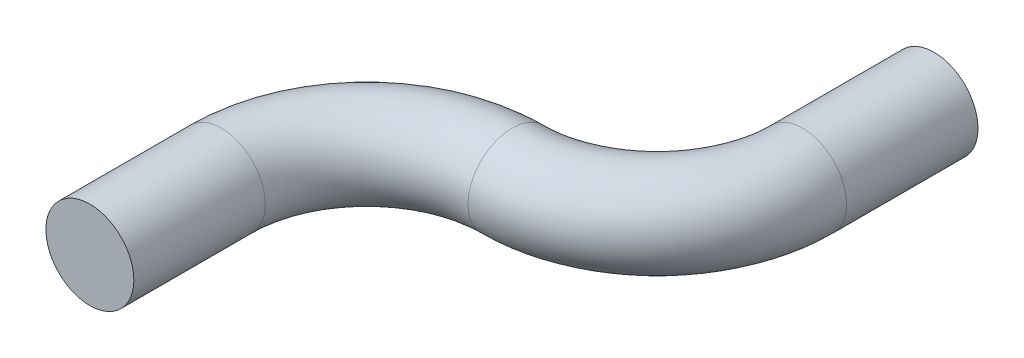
from build123d import *

# Parameters (mm, degrees)
SKETCH2_R = 15.202778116


with BuildPart() as part:
    # Sweep1: sweep along a path in Sketch1
    with BuildLine(Plane(origin=(0, 0, 0), x_dir=(1, 0, 0), z_dir=(0, 1, 0))) as sweep1_path:
        Line((0, 0), (0, 45.45766844))
        ThreePointArc((0, 45.45766844), (14.715742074, 80.984612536), (50.24268617, 95.70035461))
        ThreePointArc((50.24268617, 95.70035461), (85.769630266, 110.416096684), (100.48537234, 145.94304078))
        Line((100.48537234, 145.94304078), (100.48537234, 191.40070922))
    # Sketch2 → Sweep1 (sweep)
    with BuildSketch(Plane.XY):
        Circle(SKETCH2_R)
    sweep(path=sweep1_path.line)


solid = part.part
